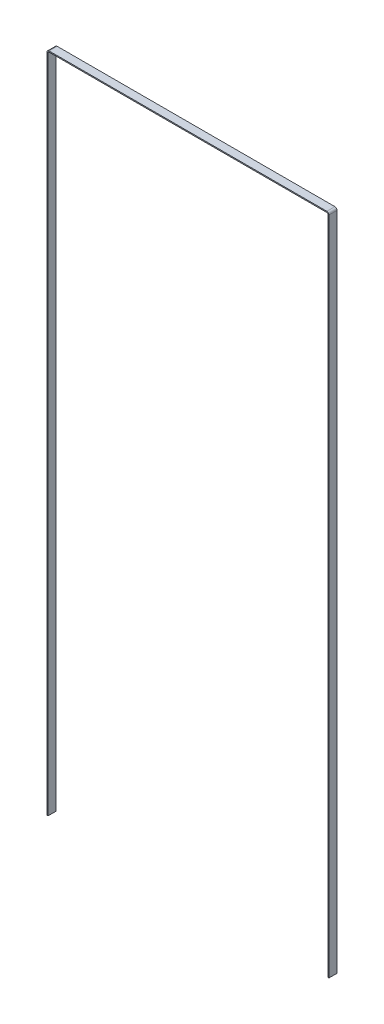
from build123d import *

# Parameters (mm, degrees)
BOSS_EXTRU_1_DEPTH = 15


with BuildPart() as part:
    # Esquisse1 → Boss.-Extru.1 (new body)
    with BuildSketch(Plane.XY):
        with BuildLine():
            Line((2, 1228), (2, 0))
            Line((2, 0), (0, 0))
            Line((0, 0), (0, 1228))
            ThreePointArc((0, 1228), (-0.585786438, 1229.414213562), (-2, 1230))
            Line((-2, 1230), (-518, 1230))
            ThreePointArc((-518, 1230), (-519.414213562, 1229.414213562), (-520, 1228))
            Line((-520, 1228), (-520, 0))
            Line((-520, 0), (-522, 0))
            Line((-522, 0), (-522, 1228))
            ThreePointArc((-522, 1228), (-520.828427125, 1230.828427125), (-518, 1232))
            Line((-518, 1232), (-2, 1232))
            ThreePointArc((-2, 1232), (0.828427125, 1230.828427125), (2, 1228))
        make_face()
    extrude(amount=BOSS_EXTRU_1_DEPTH)


solid = part.part
